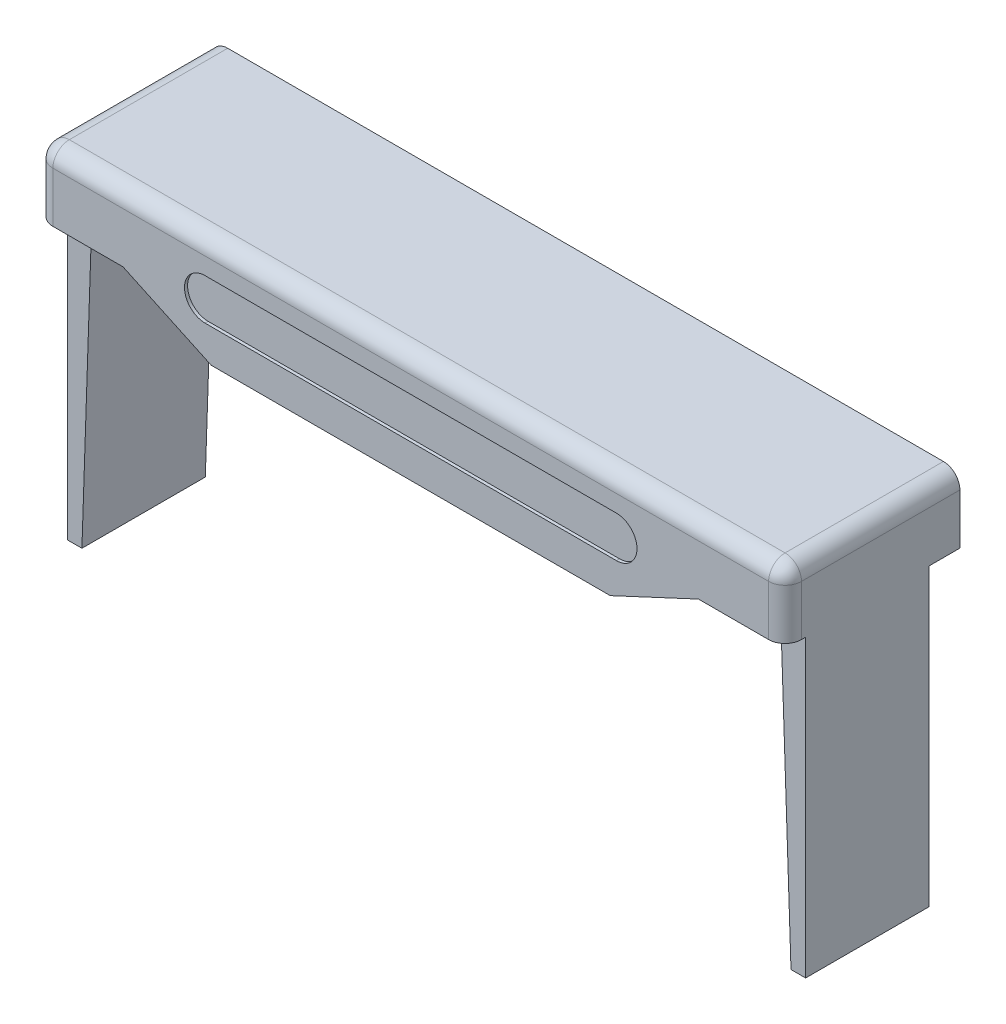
ISO-10303-21;
HEADER;
FILE_DESCRIPTION(('STEP AP214'),'2;1');
FILE_NAME('part.step','',(''),(''),'','','');
FILE_SCHEMA(('AUTOMOTIVE_DESIGN { 1 0 10303 214 1 1 1 1 }'));
ENDSEC;
DATA;
#1=APPLICATION_CONTEXT('core data for automotive mechanical design processes');
#2=APPLICATION_PROTOCOL_DEFINITION('international standard','automotive_design',2000,#1);
#3=PRODUCT_CONTEXT('',#1,'mechanical');
#4=PRODUCT('Part','Part','',(#3));
#5=PRODUCT_RELATED_PRODUCT_CATEGORY('part','',(#4));
#6=PRODUCT_DEFINITION_FORMATION('','',#4);
#7=PRODUCT_DEFINITION_CONTEXT('part definition',#1,'design');
#8=PRODUCT_DEFINITION('design','',#6,#7);
#9=PRODUCT_DEFINITION_SHAPE('','',#8);
#10=(LENGTH_UNIT() NAMED_UNIT(*) SI_UNIT(.MILLI.,.METRE.));
#11=(NAMED_UNIT(*) PLANE_ANGLE_UNIT() SI_UNIT($,.RADIAN.));
#12=(NAMED_UNIT(*) SI_UNIT($,.STERADIAN.) SOLID_ANGLE_UNIT());
#13=UNCERTAINTY_MEASURE_WITH_UNIT(LENGTH_MEASURE(1.E-05),#10,'distance_accuracy_value','');
#14=(GEOMETRIC_REPRESENTATION_CONTEXT(3) GLOBAL_UNCERTAINTY_ASSIGNED_CONTEXT((#13)) GLOBAL_UNIT_ASSIGNED_CONTEXT((#10,
#11,#12)) REPRESENTATION_CONTEXT('',''));
#15=CARTESIAN_POINT('',(0.,0.,0.));
#16=DIRECTION('',(0.,0.,1.));
#17=DIRECTION('',(1.,0.,0.));
#18=AXIS2_PLACEMENT_3D('',#15,#16,#17);
#19=CARTESIAN_POINT('',(0.,-4.,-5.5));
#20=DIRECTION('',(0.,0.,-1.));
#21=DIRECTION('',(0.,1.,0.));
#22=AXIS2_PLACEMENT_3D('',#19,#20,#21);
#23=PLANE('',#22);
#24=DIRECTION('',(-0.0340228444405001,0.999421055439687,0.));
#25=VECTOR('',#24,1.);
#26=CARTESIAN_POINT('',(34.9770212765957,-28.7,-5.5));
#27=LINE('',#26,#25);
#28=CARTESIAN_POINT('',(34.9770212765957,-28.7,-5.5));
#29=VERTEX_POINT('',#28);
#30=CARTESIAN_POINT('',(34.,0.,-5.5));
#31=VERTEX_POINT('',#30);
#32=EDGE_CURVE('E439',#29,#31,#27,.T.);
#33=ORIENTED_EDGE('',*,*,#32,.T.);
#34=DIRECTION('',(1.,0.,0.));
#35=VECTOR('',#34,1.);
#36=CARTESIAN_POINT('',(36.4,0.,-5.5));
#37=LINE('',#36,#35);
#38=CARTESIAN_POINT('',(36.4,0.,-5.5));
#39=VERTEX_POINT('',#38);
#40=EDGE_CURVE('E311',#31,#39,#37,.T.);
#41=ORIENTED_EDGE('',*,*,#40,.T.);
#42=DIRECTION('',(0.,-1.,0.));
#43=VECTOR('',#42,1.);
#44=CARTESIAN_POINT('',(36.4,0.,-5.5));
#45=LINE('',#44,#43);
#46=CARTESIAN_POINT('',(36.4,-28.7,-5.5));
#47=VERTEX_POINT('',#46);
#48=EDGE_CURVE('E296',#39,#47,#45,.T.);
#49=ORIENTED_EDGE('',*,*,#48,.T.);
#50=DIRECTION('',(-1.,0.,0.));
#51=VECTOR('',#50,1.);
#52=CARTESIAN_POINT('',(36.4,-28.7,-5.5));
#53=LINE('',#52,#51);
#54=EDGE_CURVE('E544',#47,#29,#53,.T.);
#55=ORIENTED_EDGE('',*,*,#54,.T.);
#56=EDGE_LOOP('',(#33,#41,#49,#55));
#57=FACE_BOUND('',#56,.T.);
#58=ADVANCED_FACE('F15',(#57),#23,.T.);
#59=CARTESIAN_POINT('',(0.,-4.,5.5));
#60=DIRECTION('',(0.,0.,1.));
#61=DIRECTION('',(1.,0.,0.));
#62=AXIS2_PLACEMENT_3D('',#59,#60,#61);
#63=PLANE('',#62);
#64=DIRECTION('',(0.0340228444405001,0.999421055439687,0.));
#65=VECTOR('',#64,1.);
#66=CARTESIAN_POINT('',(-34.9770212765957,-28.7,5.5));
#67=LINE('',#66,#65);
#68=CARTESIAN_POINT('',(-34.9770212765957,-28.7,5.5));
#69=VERTEX_POINT('',#68);
#70=CARTESIAN_POINT('',(-34.,0.,5.5));
#71=VERTEX_POINT('',#70);
#72=EDGE_CURVE('E478',#69,#71,#67,.T.);
#73=ORIENTED_EDGE('',*,*,#72,.T.);
#74=DIRECTION('',(-1.,0.,0.));
#75=VECTOR('',#74,1.);
#76=CARTESIAN_POINT('',(-36.4,0.,5.5));
#77=LINE('',#76,#75);
#78=CARTESIAN_POINT('',(-36.4,0.,5.5));
#79=VERTEX_POINT('',#78);
#80=EDGE_CURVE('E289',#71,#79,#77,.T.);
#81=ORIENTED_EDGE('',*,*,#80,.T.);
#82=DIRECTION('',(0.,-1.,0.));
#83=VECTOR('',#82,1.);
#84=CARTESIAN_POINT('',(-36.4,0.,5.5));
#85=LINE('',#84,#83);
#86=CARTESIAN_POINT('',(-36.4,-28.7,5.5));
#87=VERTEX_POINT('',#86);
#88=EDGE_CURVE('E367',#79,#87,#85,.T.);
#89=ORIENTED_EDGE('',*,*,#88,.T.);
#90=DIRECTION('',(1.,0.,0.));
#91=VECTOR('',#90,1.);
#92=CARTESIAN_POINT('',(-36.4,-28.7,5.5));
#93=LINE('',#92,#91);
#94=EDGE_CURVE('E457',#87,#69,#93,.T.);
#95=ORIENTED_EDGE('',*,*,#94,.T.);
#96=EDGE_LOOP('',(#73,#81,#89,#95));
#97=FACE_BOUND('',#96,.T.);
#98=ADVANCED_FACE('F527',(#97),#63,.T.);
#99=CARTESIAN_POINT('',(20.,1.25,8.2));
#100=DIRECTION('',(0.,0.,-1.));
#101=DIRECTION('',(0.,1.,0.));
#102=AXIS2_PLACEMENT_3D('',#99,#100,#101);
#103=PLANE('',#102);
#104=CARTESIAN_POINT('',(20.,1.25,8.2));
#105=DIRECTION('',(0.,0.,-1.));
#106=DIRECTION('',(0.,1.,0.));
#107=AXIS2_PLACEMENT_3D('',#104,#105,#106);
#108=CIRCLE('',#107,2.);
#109=CARTESIAN_POINT('',(20.,3.25,8.2));
#110=VERTEX_POINT('',#109);
#111=CARTESIAN_POINT('',(20.,-0.75,8.2));
#112=VERTEX_POINT('',#111);
#113=EDGE_CURVE('E274',#110,#112,#108,.T.);
#114=ORIENTED_EDGE('',*,*,#113,.F.);
#115=DIRECTION('',(1.,0.,0.));
#116=VECTOR('',#115,1.);
#117=CARTESIAN_POINT('',(20.,3.25,8.2));
#118=LINE('',#117,#116);
#119=CARTESIAN_POINT('',(-20.,3.25,8.2));
#120=VERTEX_POINT('',#119);
#121=EDGE_CURVE('E10',#120,#110,#118,.T.);
#122=ORIENTED_EDGE('',*,*,#121,.F.);
#123=CARTESIAN_POINT('',(-20.,1.25,8.2));
#124=DIRECTION('',(0.,0.,-1.));
#125=DIRECTION('',(0.,1.,0.));
#126=AXIS2_PLACEMENT_3D('',#123,#124,#125);
#127=CIRCLE('',#126,2.);
#128=CARTESIAN_POINT('',(-20.,-0.75,8.2));
#129=VERTEX_POINT('',#128);
#130=EDGE_CURVE('E40',#129,#120,#127,.T.);
#131=ORIENTED_EDGE('',*,*,#130,.F.);
#132=DIRECTION('',(-1.,0.,0.));
#133=VECTOR('',#132,1.);
#134=CARTESIAN_POINT('',(20.,-0.75,8.2));
#135=LINE('',#134,#133);
#136=EDGE_CURVE('E340',#112,#129,#135,.T.);
#137=ORIENTED_EDGE('',*,*,#136,.F.);
#138=EDGE_LOOP('',(#114,#122,#131,#137));
#139=FACE_BOUND('',#138,.T.);
#140=ADVANCED_FACE('F525',(#139),#103,.F.);
#141=CARTESIAN_POINT('',(20.,3.25,8.2));
#142=DIRECTION('',(0.,-1.,0.));
#143=DIRECTION('',(1.,0.,0.));
#144=AXIS2_PLACEMENT_3D('',#141,#142,#143);
#145=PLANE('',#144);
#146=DIRECTION('',(1.,0.,0.));
#147=VECTOR('',#146,1.);
#148=CARTESIAN_POINT('',(20.,3.25,8.5));
#149=LINE('',#148,#147);
#150=CARTESIAN_POINT('',(-20.,3.25,8.5));
#151=VERTEX_POINT('',#150);
#152=CARTESIAN_POINT('',(20.,3.25,8.5));
#153=VERTEX_POINT('',#152);
#154=EDGE_CURVE('E360',#151,#153,#149,.T.);
#155=ORIENTED_EDGE('',*,*,#154,.F.);
#156=DIRECTION('',(0.,0.,1.));
#157=VECTOR('',#156,1.);
#158=CARTESIAN_POINT('',(-20.,3.25,8.2));
#159=LINE('',#158,#157);
#160=EDGE_CURVE('E18',#120,#151,#159,.T.);
#161=ORIENTED_EDGE('',*,*,#160,.F.);
#162=ORIENTED_EDGE('',*,*,#121,.T.);
#163=DIRECTION('',(0.,0.,1.));
#164=VECTOR('',#163,1.);
#165=CARTESIAN_POINT('',(20.,3.25,8.2));
#166=LINE('',#165,#164);
#167=EDGE_CURVE('E271',#110,#153,#166,.T.);
#168=ORIENTED_EDGE('',*,*,#167,.T.);
#169=EDGE_LOOP('',(#155,#161,#162,#168));
#170=FACE_BOUND('',#169,.T.);
#171=ADVANCED_FACE('F361',(#170),#145,.T.);
#172=CARTESIAN_POINT('',(-20.,1.25,8.2));
#173=DIRECTION('',(0.,0.,1.));
#174=DIRECTION('',(0.,-1.,0.));
#175=AXIS2_PLACEMENT_3D('',#172,#173,#174);
#176=CYLINDRICAL_SURFACE('',#175,2.);
#177=CARTESIAN_POINT('',(-20.,1.25,8.5));
#178=DIRECTION('',(0.,0.,-1.));
#179=DIRECTION('',(0.,1.,0.));
#180=AXIS2_PLACEMENT_3D('',#177,#178,#179);
#181=CIRCLE('',#180,2.);
#182=CARTESIAN_POINT('',(-20.,-0.75,8.5));
#183=VERTEX_POINT('',#182);
#184=EDGE_CURVE('E356',#183,#151,#181,.T.);
#185=ORIENTED_EDGE('',*,*,#184,.F.);
#186=DIRECTION('',(0.,0.,1.));
#187=VECTOR('',#186,1.);
#188=CARTESIAN_POINT('',(-20.,-0.75,8.2));
#189=LINE('',#188,#187);
#190=EDGE_CURVE('E344',#129,#183,#189,.T.);
#191=ORIENTED_EDGE('',*,*,#190,.F.);
#192=ORIENTED_EDGE('',*,*,#130,.T.);
#193=ORIENTED_EDGE('',*,*,#160,.T.);
#194=EDGE_LOOP('',(#185,#191,#192,#193));
#195=FACE_BOUND('',#194,.T.);
#196=ADVANCED_FACE('F354',(#195),#176,.F.);
#197=CARTESIAN_POINT('',(20.,-0.75,8.2));
#198=DIRECTION('',(0.,1.,0.));
#199=DIRECTION('',(0.,0.,-1.));
#200=AXIS2_PLACEMENT_3D('',#197,#198,#199);
#201=PLANE('',#200);
#202=DIRECTION('',(-1.,0.,0.));
#203=VECTOR('',#202,1.);
#204=CARTESIAN_POINT('',(20.,-0.75,8.5));
#205=LINE('',#204,#203);
#206=CARTESIAN_POINT('',(20.,-0.75,8.5));
#207=VERTEX_POINT('',#206);
#208=EDGE_CURVE('E372',#207,#183,#205,.T.);
#209=ORIENTED_EDGE('',*,*,#208,.F.);
#210=DIRECTION('',(0.,0.,1.));
#211=VECTOR('',#210,1.);
#212=CARTESIAN_POINT('',(20.,-0.75,8.2));
#213=LINE('',#212,#211);
#214=EDGE_CURVE('E337',#112,#207,#213,.T.);
#215=ORIENTED_EDGE('',*,*,#214,.F.);
#216=ORIENTED_EDGE('',*,*,#136,.T.);
#217=ORIENTED_EDGE('',*,*,#190,.T.);
#218=EDGE_LOOP('',(#209,#215,#216,#217));
#219=FACE_BOUND('',#218,.T.);
#220=ADVANCED_FACE('F524',(#219),#201,.T.);
#221=CARTESIAN_POINT('',(20.,1.25,8.2));
#222=DIRECTION('',(0.,0.,1.));
#223=DIRECTION('',(0.,-1.,0.));
#224=AXIS2_PLACEMENT_3D('',#221,#222,#223);
#225=CYLINDRICAL_SURFACE('',#224,2.);
#226=CARTESIAN_POINT('',(20.,1.25,8.5));
#227=DIRECTION('',(0.,0.,-1.));
#228=DIRECTION('',(0.,1.,0.));
#229=AXIS2_PLACEMENT_3D('',#226,#227,#228);
#230=CIRCLE('',#229,2.);
#231=EDGE_CURVE('E378',#153,#207,#230,.T.);
#232=ORIENTED_EDGE('',*,*,#231,.F.);
#233=ORIENTED_EDGE('',*,*,#167,.F.);
#234=ORIENTED_EDGE('',*,*,#113,.T.);
#235=ORIENTED_EDGE('',*,*,#214,.T.);
#236=EDGE_LOOP('',(#232,#233,#234,#235));
#237=FACE_BOUND('',#236,.T.);
#238=ADVANCED_FACE('F521',(#237),#225,.F.);
#239=CARTESIAN_POINT('',(34.8,4.9,-8.5));
#240=DIRECTION('',(0.,0.,1.));
#241=DIRECTION('',(0.,-1.,0.));
#242=AXIS2_PLACEMENT_3D('',#239,#240,#241);
#243=CYLINDRICAL_SURFACE('',#242,1.6);
#244=CARTESIAN_POINT('',(34.8,4.9,-8.5));
#245=DIRECTION('',(0.,0.,-1.));
#246=DIRECTION('',(0.,1.,0.));
#247=AXIS2_PLACEMENT_3D('',#244,#245,#246);
#248=CIRCLE('',#247,1.6);
#249=CARTESIAN_POINT('',(34.8,6.5,-8.5));
#250=VERTEX_POINT('',#249);
#251=CARTESIAN_POINT('',(36.4,4.9,-8.5));
#252=VERTEX_POINT('',#251);
#253=EDGE_CURVE('E232',#250,#252,#248,.T.);
#254=ORIENTED_EDGE('',*,*,#253,.F.);
#255=DIRECTION('',(0.,0.,-1.));
#256=VECTOR('',#255,1.);
#257=CARTESIAN_POINT('',(34.8,6.5,-8.5));
#258=LINE('',#257,#256);
#259=CARTESIAN_POINT('',(34.8,6.5,6.9));
#260=VERTEX_POINT('',#259);
#261=EDGE_CURVE('E281',#260,#250,#258,.T.);
#262=ORIENTED_EDGE('',*,*,#261,.F.);
#263=CARTESIAN_POINT('',(34.8,4.9,6.9));
#264=DIRECTION('',(0.,0.,-1.));
#265=DIRECTION('',(0.,-1.,0.));
#266=AXIS2_PLACEMENT_3D('',#263,#264,#265);
#267=CIRCLE('',#266,1.6);
#268=CARTESIAN_POINT('',(36.4,4.9,6.9));
#269=VERTEX_POINT('',#268);
#270=EDGE_CURVE('E234',#260,#269,#267,.T.);
#271=ORIENTED_EDGE('',*,*,#270,.T.);
#272=DIRECTION('',(0.,0.,1.));
#273=VECTOR('',#272,1.);
#274=CARTESIAN_POINT('',(36.4,4.9,-8.5));
#275=LINE('',#274,#273);
#276=EDGE_CURVE('E227',#252,#269,#275,.T.);
#277=ORIENTED_EDGE('',*,*,#276,.F.);
#278=EDGE_LOOP('',(#254,#262,#271,#277));
#279=FACE_BOUND('',#278,.T.);
#280=ADVANCED_FACE('F229',(#279),#243,.T.);
#281=CARTESIAN_POINT('',(34.8,4.9,6.9));
#282=DIRECTION('',(0.,0.,1.));
#283=DIRECTION('',(1.,0.,0.));
#284=AXIS2_PLACEMENT_3D('',#281,#282,#283);
#285=SPHERICAL_SURFACE('',#284,1.6);
#286=CARTESIAN_POINT('',(34.8,4.9,6.9));
#287=DIRECTION('',(1.,0.,0.));
#288=DIRECTION('',(0.,1.,0.));
#289=AXIS2_PLACEMENT_3D('',#286,#287,#288);
#290=CIRCLE('',#289,1.6);
#291=CARTESIAN_POINT('',(34.8,4.9,8.5));
#292=VERTEX_POINT('',#291);
#293=EDGE_CURVE('E331',#260,#292,#290,.T.);
#294=ORIENTED_EDGE('',*,*,#293,.T.);
#295=CARTESIAN_POINT('',(34.8,4.9,6.9));
#296=DIRECTION('',(0.,1.,0.));
#297=DIRECTION('',(-1.,0.,0.));
#298=AXIS2_PLACEMENT_3D('',#295,#296,#297);
#299=CIRCLE('',#298,1.6);
#300=EDGE_CURVE('E328',#292,#269,#299,.T.);
#301=ORIENTED_EDGE('',*,*,#300,.T.);
#302=ORIENTED_EDGE('',*,*,#270,.F.);
#303=EDGE_LOOP('',(#294,#301,#302));
#304=FACE_BOUND('',#303,.T.);
#305=ADVANCED_FACE('F599',(#304),#285,.T.);
#306=CARTESIAN_POINT('',(-36.4,4.9,6.9));
#307=DIRECTION('',(1.,0.,0.));
#308=DIRECTION('',(0.,1.,0.));
#309=AXIS2_PLACEMENT_3D('',#306,#307,#308);
#310=CYLINDRICAL_SURFACE('',#309,1.6);
#311=CARTESIAN_POINT('',(-34.8,4.9,6.9));
#312=DIRECTION('',(1.,0.,0.));
#313=DIRECTION('',(0.,-1.,0.));
#314=AXIS2_PLACEMENT_3D('',#311,#312,#313);
#315=CIRCLE('',#314,1.6);
#316=CARTESIAN_POINT('',(-34.8,6.5,6.9));
#317=VERTEX_POINT('',#316);
#318=CARTESIAN_POINT('',(-34.8,4.9,8.5));
#319=VERTEX_POINT('',#318);
#320=EDGE_CURVE('E325',#317,#319,#315,.T.);
#321=ORIENTED_EDGE('',*,*,#320,.T.);
#322=DIRECTION('',(-1.,0.,0.));
#323=VECTOR('',#322,1.);
#324=CARTESIAN_POINT('',(-36.4,4.9,8.5));
#325=LINE('',#324,#323);
#326=EDGE_CURVE('E491',#292,#319,#325,.T.);
#327=ORIENTED_EDGE('',*,*,#326,.F.);
#328=ORIENTED_EDGE('',*,*,#293,.F.);
#329=DIRECTION('',(1.,0.,0.));
#330=VECTOR('',#329,1.);
#331=CARTESIAN_POINT('',(36.4,6.5,6.9));
#332=LINE('',#331,#330);
#333=EDGE_CURVE('E280',#317,#260,#332,.T.);
#334=ORIENTED_EDGE('',*,*,#333,.F.);
#335=EDGE_LOOP('',(#321,#327,#328,#334));
#336=FACE_BOUND('',#335,.T.);
#337=ADVANCED_FACE('F595',(#336),#310,.T.);
#338=CARTESIAN_POINT('',(34.8,-4.,6.9));
#339=DIRECTION('',(0.,1.,0.));
#340=DIRECTION('',(-1.,0.,0.));
#341=AXIS2_PLACEMENT_3D('',#338,#339,#340);
#342=CYLINDRICAL_SURFACE('',#341,1.6);
#343=CARTESIAN_POINT('',(34.8,0.,6.9));
#344=DIRECTION('',(0.,-1.,0.));
#345=DIRECTION('',(1.,0.,0.));
#346=AXIS2_PLACEMENT_3D('',#343,#344,#345);
#347=CIRCLE('',#346,1.6);
#348=CARTESIAN_POINT('',(36.4,0.,6.9));
#349=VERTEX_POINT('',#348);
#350=CARTESIAN_POINT('',(34.8,0.,8.5));
#351=VERTEX_POINT('',#350);
#352=EDGE_CURVE('E315',#349,#351,#347,.T.);
#353=ORIENTED_EDGE('',*,*,#352,.F.);
#354=DIRECTION('',(0.,-1.,0.));
#355=VECTOR('',#354,1.);
#356=CARTESIAN_POINT('',(36.4,0.,6.9));
#357=LINE('',#356,#355);
#358=EDGE_CURVE('E239',#269,#349,#357,.T.);
#359=ORIENTED_EDGE('',*,*,#358,.F.);
#360=ORIENTED_EDGE('',*,*,#300,.F.);
#361=DIRECTION('',(0.,1.,0.));
#362=VECTOR('',#361,1.);
#363=CARTESIAN_POINT('',(34.8,6.5,8.5));
#364=LINE('',#363,#362);
#365=EDGE_CURVE('E487',#351,#292,#364,.T.);
#366=ORIENTED_EDGE('',*,*,#365,.F.);
#367=EDGE_LOOP('',(#353,#359,#360,#366));
#368=FACE_BOUND('',#367,.T.);
#369=ADVANCED_FACE('F603',(#368),#342,.T.);
#370=CARTESIAN_POINT('',(-34.8,4.9,6.9));
#371=DIRECTION('',(0.,0.,1.));
#372=DIRECTION('',(1.,0.,0.));
#373=AXIS2_PLACEMENT_3D('',#370,#371,#372);
#374=SPHERICAL_SURFACE('',#373,1.6);
#375=CARTESIAN_POINT('',(-34.8,4.9,6.9));
#376=DIRECTION('',(0.,0.,1.));
#377=DIRECTION('',(0.,-1.,0.));
#378=AXIS2_PLACEMENT_3D('',#375,#376,#377);
#379=CIRCLE('',#378,1.6);
#380=CARTESIAN_POINT('',(-36.4,4.9,6.9));
#381=VERTEX_POINT('',#380);
#382=EDGE_CURVE('E322',#317,#381,#379,.T.);
#383=ORIENTED_EDGE('',*,*,#382,.T.);
#384=CARTESIAN_POINT('',(-34.8,4.9,6.9));
#385=DIRECTION('',(0.,1.,0.));
#386=DIRECTION('',(-1.,0.,0.));
#387=AXIS2_PLACEMENT_3D('',#384,#385,#386);
#388=CIRCLE('',#387,1.6);
#389=EDGE_CURVE('E318',#381,#319,#388,.T.);
#390=ORIENTED_EDGE('',*,*,#389,.T.);
#391=ORIENTED_EDGE('',*,*,#320,.F.);
#392=EDGE_LOOP('',(#383,#390,#391));
#393=FACE_BOUND('',#392,.T.);
#394=ADVANCED_FACE('F640',(#393),#374,.T.);
#395=CARTESIAN_POINT('',(-34.8,4.9,-8.5));
#396=DIRECTION('',(0.,0.,1.));
#397=DIRECTION('',(0.,-1.,0.));
#398=AXIS2_PLACEMENT_3D('',#395,#396,#397);
#399=CYLINDRICAL_SURFACE('',#398,1.6);
#400=CARTESIAN_POINT('',(-34.8,4.9,-8.5));
#401=DIRECTION('',(0.,0.,-1.));
#402=DIRECTION('',(0.,1.,0.));
#403=AXIS2_PLACEMENT_3D('',#400,#401,#402);
#404=CIRCLE('',#403,1.6);
#405=CARTESIAN_POINT('',(-36.4,4.9,-8.5));
#406=VERTEX_POINT('',#405);
#407=CARTESIAN_POINT('',(-34.8,6.5,-8.5));
#408=VERTEX_POINT('',#407);
#409=EDGE_CURVE('E277',#406,#408,#404,.T.);
#410=ORIENTED_EDGE('',*,*,#409,.F.);
#411=DIRECTION('',(0.,0.,-1.));
#412=VECTOR('',#411,1.);
#413=CARTESIAN_POINT('',(-36.4,4.9,-8.5));
#414=LINE('',#413,#412);
#415=EDGE_CURVE('E394',#381,#406,#414,.T.);
#416=ORIENTED_EDGE('',*,*,#415,.F.);
#417=ORIENTED_EDGE('',*,*,#382,.F.);
#418=DIRECTION('',(0.,0.,1.));
#419=VECTOR('',#418,1.);
#420=CARTESIAN_POINT('',(-34.8,6.5,-8.5));
#421=LINE('',#420,#419);
#422=EDGE_CURVE('E283',#408,#317,#421,.T.);
#423=ORIENTED_EDGE('',*,*,#422,.F.);
#424=EDGE_LOOP('',(#410,#416,#417,#423));
#425=FACE_BOUND('',#424,.T.);
#426=ADVANCED_FACE('F589',(#425),#399,.T.);
#427=CARTESIAN_POINT('',(-34.8,6.5,6.9));
#428=DIRECTION('',(0.,1.,0.));
#429=DIRECTION('',(-1.,0.,0.));
#430=AXIS2_PLACEMENT_3D('',#427,#428,#429);
#431=CYLINDRICAL_SURFACE('',#430,1.6);
#432=CARTESIAN_POINT('',(-34.8,0.,6.9));
#433=DIRECTION('',(0.,-1.,0.));
#434=DIRECTION('',(1.,0.,0.));
#435=AXIS2_PLACEMENT_3D('',#432,#433,#434);
#436=CIRCLE('',#435,1.6);
#437=CARTESIAN_POINT('',(-34.8,0.,8.5));
#438=VERTEX_POINT('',#437);
#439=CARTESIAN_POINT('',(-36.4,0.,6.9));
#440=VERTEX_POINT('',#439);
#441=EDGE_CURVE('E293',#438,#440,#436,.T.);
#442=ORIENTED_EDGE('',*,*,#441,.F.);
#443=DIRECTION('',(0.,-1.,0.));
#444=VECTOR('',#443,1.);
#445=CARTESIAN_POINT('',(-34.8,0.,8.5));
#446=LINE('',#445,#444);
#447=EDGE_CURVE('E497',#319,#438,#446,.T.);
#448=ORIENTED_EDGE('',*,*,#447,.F.);
#449=ORIENTED_EDGE('',*,*,#389,.F.);
#450=DIRECTION('',(0.,1.,0.));
#451=VECTOR('',#450,1.);
#452=CARTESIAN_POINT('',(-36.4,6.5,6.9));
#453=LINE('',#452,#451);
#454=EDGE_CURVE('E390',#440,#381,#453,.T.);
#455=ORIENTED_EDGE('',*,*,#454,.F.);
#456=EDGE_LOOP('',(#442,#448,#449,#455));
#457=FACE_BOUND('',#456,.T.);
#458=ADVANCED_FACE('F607',(#457),#431,.T.);
#459=CARTESIAN_POINT('',(0.,-4.,6.5));
#460=DIRECTION('',(0.,0.,1.));
#461=DIRECTION('',(1.,0.,0.));
#462=AXIS2_PLACEMENT_3D('',#459,#460,#461);
#463=PLANE('',#462);
#464=DIRECTION('',(-1.,0.,0.));
#465=VECTOR('',#464,1.);
#466=CARTESIAN_POINT('',(34.9770212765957,-28.7,6.5));
#467=LINE('',#466,#465);
#468=CARTESIAN_POINT('',(36.4,-28.7,6.5));
#469=VERTEX_POINT('',#468);
#470=CARTESIAN_POINT('',(34.9770212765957,-28.7,6.5));
#471=VERTEX_POINT('',#470);
#472=EDGE_CURVE('E432',#469,#471,#467,.T.);
#473=ORIENTED_EDGE('',*,*,#472,.F.);
#474=DIRECTION('',(0.,-1.,0.));
#475=VECTOR('',#474,1.);
#476=CARTESIAN_POINT('',(36.4,0.,6.5));
#477=LINE('',#476,#475);
#478=CARTESIAN_POINT('',(36.4,0.,6.5));
#479=VERTEX_POINT('',#478);
#480=EDGE_CURVE('E307',#479,#469,#477,.T.);
#481=ORIENTED_EDGE('',*,*,#480,.F.);
#482=DIRECTION('',(1.,0.,0.));
#483=VECTOR('',#482,1.);
#484=CARTESIAN_POINT('',(36.4,0.,6.5));
#485=LINE('',#484,#483);
#486=CARTESIAN_POINT('',(34.,0.,6.5));
#487=VERTEX_POINT('',#486);
#488=EDGE_CURVE('E314',#487,#479,#485,.T.);
#489=ORIENTED_EDGE('',*,*,#488,.F.);
#490=DIRECTION('',(-0.0340228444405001,0.999421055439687,0.));
#491=VECTOR('',#490,1.);
#492=CARTESIAN_POINT('',(34.9770212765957,-28.7,6.5));
#493=LINE('',#492,#491);
#494=EDGE_CURVE('E444',#471,#487,#493,.T.);
#495=ORIENTED_EDGE('',*,*,#494,.F.);
#496=EDGE_LOOP('',(#473,#481,#489,#495));
#497=FACE_BOUND('',#496,.T.);
#498=ADVANCED_FACE('F556',(#497),#463,.T.);
#499=CARTESIAN_POINT('',(27.9780276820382,0.,8.5));
#500=DIRECTION('',(0.,-1.,0.));
#501=DIRECTION('',(1.,0.,0.));
#502=AXIS2_PLACEMENT_3D('',#499,#500,#501);
#503=PLANE('',#502);
#504=ORIENTED_EDGE('',*,*,#40,.F.);
#505=DIRECTION('',(0.,0.,-1.));
#506=VECTOR('',#505,1.);
#507=CARTESIAN_POINT('',(34.,0.,6.5));
#508=LINE('',#507,#506);
#509=EDGE_CURVE('E453',#487,#31,#508,.T.);
#510=ORIENTED_EDGE('',*,*,#509,.F.);
#511=ORIENTED_EDGE('',*,*,#488,.T.);
#512=DIRECTION('',(0.,0.,-1.));
#513=VECTOR('',#512,1.);
#514=CARTESIAN_POINT('',(36.4,0.,8.5));
#515=LINE('',#514,#513);
#516=EDGE_CURVE('E303',#349,#479,#515,.T.);
#517=ORIENTED_EDGE('',*,*,#516,.F.);
#518=ORIENTED_EDGE('',*,*,#352,.T.);
#519=DIRECTION('',(1.,0.,0.));
#520=VECTOR('',#519,1.);
#521=CARTESIAN_POINT('',(27.9780276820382,0.,8.5));
#522=LINE('',#521,#520);
#523=CARTESIAN_POINT('',(27.9780276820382,0.,8.5));
#524=VERTEX_POINT('',#523);
#525=EDGE_CURVE('E483',#524,#351,#522,.T.);
#526=ORIENTED_EDGE('',*,*,#525,.F.);
#527=DIRECTION('',(0.,0.,-1.));
#528=VECTOR('',#527,1.);
#529=CARTESIAN_POINT('',(27.9780276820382,0.,8.5));
#530=LINE('',#529,#528);
#531=CARTESIAN_POINT('',(27.9780276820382,0.,-8.5));
#532=VERTEX_POINT('',#531);
#533=EDGE_CURVE('E310',#524,#532,#530,.T.);
#534=ORIENTED_EDGE('',*,*,#533,.T.);
#535=DIRECTION('',(1.,0.,0.));
#536=VECTOR('',#535,1.);
#537=CARTESIAN_POINT('',(36.4,0.,-8.5));
#538=LINE('',#537,#536);
#539=CARTESIAN_POINT('',(36.4,0.,-8.5));
#540=VERTEX_POINT('',#539);
#541=EDGE_CURVE('E251',#532,#540,#538,.T.);
#542=ORIENTED_EDGE('',*,*,#541,.T.);
#543=DIRECTION('',(0.,0.,-1.));
#544=VECTOR('',#543,1.);
#545=CARTESIAN_POINT('',(36.4,0.,8.5));
#546=LINE('',#545,#544);
#547=EDGE_CURVE('E240',#39,#540,#546,.T.);
#548=ORIENTED_EDGE('',*,*,#547,.F.);
#549=EDGE_LOOP('',(#504,#510,#511,#517,#518,#526,#534,#542,#548));
#550=FACE_BOUND('',#549,.T.);
#551=ADVANCED_FACE('F559',(#550),#503,.T.);
#552=CARTESIAN_POINT('',(19.4,-4.,8.5));
#553=DIRECTION('',(0.4226182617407,-0.90630778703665,0.));
#554=DIRECTION('',(0.,0.,-1.));
#555=AXIS2_PLACEMENT_3D('',#552,#553,#554);
#556=PLANE('',#555);
#557=DIRECTION('',(0.90630778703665,0.4226182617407,0.));
#558=VECTOR('',#557,1.);
#559=CARTESIAN_POINT('',(37.3854280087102,4.386742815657,-8.5));
#560=LINE('',#559,#558);
#561=CARTESIAN_POINT('',(19.4,-4.,-8.5));
#562=VERTEX_POINT('',#561);
#563=EDGE_CURVE('E270',#562,#532,#560,.T.);
#564=ORIENTED_EDGE('',*,*,#563,.T.);
#565=ORIENTED_EDGE('',*,*,#533,.F.);
#566=DIRECTION('',(0.90630778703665,0.4226182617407,0.));
#567=VECTOR('',#566,1.);
#568=CARTESIAN_POINT('',(19.4,-4.,8.5));
#569=LINE('',#568,#567);
#570=CARTESIAN_POINT('',(19.4,-4.,8.5));
#571=VERTEX_POINT('',#570);
#572=EDGE_CURVE('E515',#571,#524,#569,.T.);
#573=ORIENTED_EDGE('',*,*,#572,.F.);
#574=DIRECTION('',(0.,0.,-1.));
#575=VECTOR('',#574,1.);
#576=CARTESIAN_POINT('',(19.4,-4.,8.5));
#577=LINE('',#576,#575);
#578=EDGE_CURVE('E262',#571,#562,#577,.T.);
#579=ORIENTED_EDGE('',*,*,#578,.T.);
#580=EDGE_LOOP('',(#564,#565,#573,#579));
#581=FACE_BOUND('',#580,.T.);
#582=ADVANCED_FACE('F571',(#581),#556,.T.);
#583=CARTESIAN_POINT('',(36.4,-4.,-8.5));
#584=DIRECTION('',(1.,0.,0.));
#585=DIRECTION('',(0.,0.,1.));
#586=AXIS2_PLACEMENT_3D('',#583,#584,#585);
#587=PLANE('',#586);
#588=ORIENTED_EDGE('',*,*,#48,.F.);
#589=ORIENTED_EDGE('',*,*,#547,.T.);
#590=DIRECTION('',(0.,-1.,0.));
#591=VECTOR('',#590,1.);
#592=CARTESIAN_POINT('',(36.4,-4.,-8.5));
#593=LINE('',#592,#591);
#594=EDGE_CURVE('E243',#252,#540,#593,.T.);
#595=ORIENTED_EDGE('',*,*,#594,.F.);
#596=ORIENTED_EDGE('',*,*,#276,.T.);
#597=ORIENTED_EDGE('',*,*,#358,.T.);
#598=ORIENTED_EDGE('',*,*,#516,.T.);
#599=ORIENTED_EDGE('',*,*,#480,.T.);
#600=DIRECTION('',(0.,0.,-1.));
#601=VECTOR('',#600,1.);
#602=CARTESIAN_POINT('',(36.4,-28.7,6.5));
#603=LINE('',#602,#601);
#604=EDGE_CURVE('E436',#469,#47,#603,.T.);
#605=ORIENTED_EDGE('',*,*,#604,.T.);
#606=EDGE_LOOP('',(#588,#589,#595,#596,#597,#598,#599,#605));
#607=FACE_BOUND('',#606,.T.);
#608=ADVANCED_FACE('F245',(#607),#587,.T.);
#609=CARTESIAN_POINT('',(0.,-4.,-6.5));
#610=DIRECTION('',(0.,0.,1.));
#611=DIRECTION('',(1.,0.,0.));
#612=AXIS2_PLACEMENT_3D('',#609,#610,#611);
#613=PLANE('',#612);
#614=DIRECTION('',(1.,0.,0.));
#615=VECTOR('',#614,1.);
#616=CARTESIAN_POINT('',(-34.9770212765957,-28.7,-6.5));
#617=LINE('',#616,#615);
#618=CARTESIAN_POINT('',(-36.4,-28.7,-6.5));
#619=VERTEX_POINT('',#618);
#620=CARTESIAN_POINT('',(-34.9770212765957,-28.7,-6.5));
#621=VERTEX_POINT('',#620);
#622=EDGE_CURVE('E465',#619,#621,#617,.T.);
#623=ORIENTED_EDGE('',*,*,#622,.F.);
#624=DIRECTION('',(0.,-1.,0.));
#625=VECTOR('',#624,1.);
#626=CARTESIAN_POINT('',(-36.4,0.,-6.5));
#627=LINE('',#626,#625);
#628=CARTESIAN_POINT('',(-36.4,0.,-6.5));
#629=VERTEX_POINT('',#628);
#630=EDGE_CURVE('E408',#629,#619,#627,.T.);
#631=ORIENTED_EDGE('',*,*,#630,.F.);
#632=DIRECTION('',(-1.,0.,0.));
#633=VECTOR('',#632,1.);
#634=CARTESIAN_POINT('',(-36.4,0.,-6.5));
#635=LINE('',#634,#633);
#636=CARTESIAN_POINT('',(-34.,0.,-6.5));
#637=VERTEX_POINT('',#636);
#638=EDGE_CURVE('E292',#637,#629,#635,.T.);
#639=ORIENTED_EDGE('',*,*,#638,.F.);
#640=DIRECTION('',(0.0340228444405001,0.999421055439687,0.));
#641=VECTOR('',#640,1.);
#642=CARTESIAN_POINT('',(-34.9770212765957,-28.7,-6.5));
#643=LINE('',#642,#641);
#644=EDGE_CURVE('E482',#621,#637,#643,.T.);
#645=ORIENTED_EDGE('',*,*,#644,.F.);
#646=EDGE_LOOP('',(#623,#631,#639,#645));
#647=FACE_BOUND('',#646,.T.);
#648=ADVANCED_FACE('F618',(#647),#613,.F.);
#649=CARTESIAN_POINT('',(-27.9780276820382,0.,8.5));
#650=DIRECTION('',(0.,-1.,0.));
#651=DIRECTION('',(1.,0.,0.));
#652=AXIS2_PLACEMENT_3D('',#649,#650,#651);
#653=PLANE('',#652);
#654=ORIENTED_EDGE('',*,*,#80,.F.);
#655=DIRECTION('',(0.,0.,-1.));
#656=VECTOR('',#655,1.);
#657=CARTESIAN_POINT('',(-34.,0.,6.5));
#658=LINE('',#657,#656);
#659=EDGE_CURVE('E430',#71,#637,#658,.T.);
#660=ORIENTED_EDGE('',*,*,#659,.T.);
#661=ORIENTED_EDGE('',*,*,#638,.T.);
#662=DIRECTION('',(0.,0.,-1.));
#663=VECTOR('',#662,1.);
#664=CARTESIAN_POINT('',(-36.4,0.,8.5));
#665=LINE('',#664,#663);
#666=CARTESIAN_POINT('',(-36.4,0.,-8.5));
#667=VERTEX_POINT('',#666);
#668=EDGE_CURVE('E403',#629,#667,#665,.T.);
#669=ORIENTED_EDGE('',*,*,#668,.T.);
#670=DIRECTION('',(-1.,0.,0.));
#671=VECTOR('',#670,1.);
#672=CARTESIAN_POINT('',(-36.4,0.,-8.5));
#673=LINE('',#672,#671);
#674=CARTESIAN_POINT('',(-27.9780276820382,0.,-8.5));
#675=VERTEX_POINT('',#674);
#676=EDGE_CURVE('E269',#675,#667,#673,.T.);
#677=ORIENTED_EDGE('',*,*,#676,.F.);
#678=DIRECTION('',(0.,0.,-1.));
#679=VECTOR('',#678,1.);
#680=CARTESIAN_POINT('',(-27.9780276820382,0.,8.5));
#681=LINE('',#680,#679);
#682=CARTESIAN_POINT('',(-27.9780276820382,0.,8.5));
#683=VERTEX_POINT('',#682);
#684=EDGE_CURVE('E288',#683,#675,#681,.T.);
#685=ORIENTED_EDGE('',*,*,#684,.F.);
#686=DIRECTION('',(-1.,0.,0.));
#687=VECTOR('',#686,1.);
#688=CARTESIAN_POINT('',(-27.9780276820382,0.,8.5));
#689=LINE('',#688,#687);
#690=EDGE_CURVE('E501',#683,#438,#689,.T.);
#691=ORIENTED_EDGE('',*,*,#690,.T.);
#692=ORIENTED_EDGE('',*,*,#441,.T.);
#693=DIRECTION('',(0.,0.,-1.));
#694=VECTOR('',#693,1.);
#695=CARTESIAN_POINT('',(-36.4,0.,8.5));
#696=LINE('',#695,#694);
#697=EDGE_CURVE('E386',#440,#79,#696,.T.);
#698=ORIENTED_EDGE('',*,*,#697,.T.);
#699=EDGE_LOOP('',(#654,#660,#661,#669,#677,#685,#691,#692,#698));
#700=FACE_BOUND('',#699,.T.);
#701=ADVANCED_FACE('F580',(#700),#653,.T.);
#702=CARTESIAN_POINT('',(-19.4,-4.,8.5));
#703=DIRECTION('',(-0.4226182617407,-0.90630778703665,0.));
#704=DIRECTION('',(0.,0.,1.));
#705=AXIS2_PLACEMENT_3D('',#702,#703,#704);
#706=PLANE('',#705);
#707=DIRECTION('',(-0.90630778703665,0.4226182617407,0.));
#708=VECTOR('',#707,1.);
#709=CARTESIAN_POINT('',(-37.3854280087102,4.386742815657,-8.5));
#710=LINE('',#709,#708);
#711=CARTESIAN_POINT('',(-19.4,-4.,-8.5));
#712=VERTEX_POINT('',#711);
#713=EDGE_CURVE('E266',#712,#675,#710,.T.);
#714=ORIENTED_EDGE('',*,*,#713,.F.);
#715=DIRECTION('',(0.,0.,-1.));
#716=VECTOR('',#715,1.);
#717=CARTESIAN_POINT('',(-19.4,-4.,8.5));
#718=LINE('',#717,#716);
#719=CARTESIAN_POINT('',(-19.4,-4.,8.5));
#720=VERTEX_POINT('',#719);
#721=EDGE_CURVE('E404',#720,#712,#718,.T.);
#722=ORIENTED_EDGE('',*,*,#721,.F.);
#723=DIRECTION('',(-0.90630778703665,0.4226182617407,0.));
#724=VECTOR('',#723,1.);
#725=CARTESIAN_POINT('',(-19.4,-4.,8.5));
#726=LINE('',#725,#724);
#727=EDGE_CURVE('E507',#720,#683,#726,.T.);
#728=ORIENTED_EDGE('',*,*,#727,.T.);
#729=ORIENTED_EDGE('',*,*,#684,.T.);
#730=EDGE_LOOP('',(#714,#722,#728,#729));
#731=FACE_BOUND('',#730,.T.);
#732=ADVANCED_FACE('F577',(#731),#706,.T.);
#733=CARTESIAN_POINT('',(-36.4,6.5,-8.5));
#734=DIRECTION('',(0.,1.,0.));
#735=DIRECTION('',(0.,0.,-1.));
#736=AXIS2_PLACEMENT_3D('',#733,#734,#735);
#737=PLANE('',#736);
#738=ORIENTED_EDGE('',*,*,#333,.T.);
#739=ORIENTED_EDGE('',*,*,#261,.T.);
#740=DIRECTION('',(-1.,0.,0.));
#741=VECTOR('',#740,1.);
#742=CARTESIAN_POINT('',(-36.4,6.5,-8.5));
#743=LINE('',#742,#741);
#744=EDGE_CURVE('E256',#250,#408,#743,.T.);
#745=ORIENTED_EDGE('',*,*,#744,.T.);
#746=ORIENTED_EDGE('',*,*,#422,.T.);
#747=EDGE_LOOP('',(#738,#739,#745,#746));
#748=FACE_BOUND('',#747,.T.);
#749=ADVANCED_FACE('F592',(#748),#737,.T.);
#750=CARTESIAN_POINT('',(-36.4,6.5,-8.5));
#751=DIRECTION('',(0.,0.,-1.));
#752=DIRECTION('',(0.,1.,0.));
#753=AXIS2_PLACEMENT_3D('',#750,#751,#752);
#754=PLANE('',#753);
#755=ORIENTED_EDGE('',*,*,#744,.F.);
#756=ORIENTED_EDGE('',*,*,#253,.T.);
#757=ORIENTED_EDGE('',*,*,#594,.T.);
#758=ORIENTED_EDGE('',*,*,#541,.F.);
#759=ORIENTED_EDGE('',*,*,#563,.F.);
#760=DIRECTION('',(1.,0.,0.));
#761=VECTOR('',#760,1.);
#762=CARTESIAN_POINT('',(-36.4,-4.,-8.5));
#763=LINE('',#762,#761);
#764=EDGE_CURVE('E407',#712,#562,#763,.T.);
#765=ORIENTED_EDGE('',*,*,#764,.F.);
#766=ORIENTED_EDGE('',*,*,#713,.T.);
#767=ORIENTED_EDGE('',*,*,#676,.T.);
#768=DIRECTION('',(0.,-1.,0.));
#769=VECTOR('',#768,1.);
#770=CARTESIAN_POINT('',(-36.4,-4.,-8.5));
#771=LINE('',#770,#769);
#772=EDGE_CURVE('E398',#406,#667,#771,.T.);
#773=ORIENTED_EDGE('',*,*,#772,.F.);
#774=ORIENTED_EDGE('',*,*,#409,.T.);
#775=EDGE_LOOP('',(#755,#756,#757,#758,#759,#765,#766,#767,#773,#774));
#776=FACE_BOUND('',#775,.T.);
#777=ADVANCED_FACE('F253',(#776),#754,.T.);
#778=CARTESIAN_POINT('',(-36.4,-4.,-8.5));
#779=DIRECTION('',(0.,-1.,0.));
#780=DIRECTION('',(1.,0.,0.));
#781=AXIS2_PLACEMENT_3D('',#778,#779,#780);
#782=PLANE('',#781);
#783=DIRECTION('',(1.,0.,0.));
#784=VECTOR('',#783,1.);
#785=CARTESIAN_POINT('',(-36.4,-4.,8.5));
#786=LINE('',#785,#784);
#787=EDGE_CURVE('E511',#720,#571,#786,.T.);
#788=ORIENTED_EDGE('',*,*,#787,.F.);
#789=ORIENTED_EDGE('',*,*,#721,.T.);
#790=ORIENTED_EDGE('',*,*,#764,.T.);
#791=ORIENTED_EDGE('',*,*,#578,.F.);
#792=EDGE_LOOP('',(#788,#789,#790,#791));
#793=FACE_BOUND('',#792,.T.);
#794=ADVANCED_FACE('F573',(#793),#782,.T.);
#795=CARTESIAN_POINT('',(-36.4,-4.,-8.5));
#796=DIRECTION('',(-1.,0.,0.));
#797=DIRECTION('',(0.,-1.,0.));
#798=AXIS2_PLACEMENT_3D('',#795,#796,#797);
#799=PLANE('',#798);
#800=ORIENTED_EDGE('',*,*,#88,.F.);
#801=ORIENTED_EDGE('',*,*,#697,.F.);
#802=ORIENTED_EDGE('',*,*,#454,.T.);
#803=ORIENTED_EDGE('',*,*,#415,.T.);
#804=ORIENTED_EDGE('',*,*,#772,.T.);
#805=ORIENTED_EDGE('',*,*,#668,.F.);
#806=ORIENTED_EDGE('',*,*,#630,.T.);
#807=DIRECTION('',(0.,0.,-1.));
#808=VECTOR('',#807,1.);
#809=CARTESIAN_POINT('',(-36.4,-28.7,6.5));
#810=LINE('',#809,#808);
#811=EDGE_CURVE('E460',#87,#619,#810,.T.);
#812=ORIENTED_EDGE('',*,*,#811,.F.);
#813=EDGE_LOOP('',(#800,#801,#802,#803,#804,#805,#806,#812));
#814=FACE_BOUND('',#813,.T.);
#815=ADVANCED_FACE('F584',(#814),#799,.T.);
#816=CARTESIAN_POINT('',(-36.4,6.5,8.5));
#817=DIRECTION('',(0.,0.,-1.));
#818=DIRECTION('',(0.,1.,0.));
#819=AXIS2_PLACEMENT_3D('',#816,#817,#818);
#820=PLANE('',#819);
#821=ORIENTED_EDGE('',*,*,#231,.T.);
#822=ORIENTED_EDGE('',*,*,#208,.T.);
#823=ORIENTED_EDGE('',*,*,#184,.T.);
#824=ORIENTED_EDGE('',*,*,#154,.T.);
#825=EDGE_LOOP('',(#821,#822,#823,#824));
#826=FACE_BOUND('',#825,.T.);
#827=ORIENTED_EDGE('',*,*,#525,.T.);
#828=ORIENTED_EDGE('',*,*,#365,.T.);
#829=ORIENTED_EDGE('',*,*,#326,.T.);
#830=ORIENTED_EDGE('',*,*,#447,.T.);
#831=ORIENTED_EDGE('',*,*,#690,.F.);
#832=ORIENTED_EDGE('',*,*,#727,.F.);
#833=ORIENTED_EDGE('',*,*,#787,.T.);
#834=ORIENTED_EDGE('',*,*,#572,.T.);
#835=EDGE_LOOP('',(#827,#828,#829,#830,#831,#832,#833,#834));
#836=FACE_BOUND('',#835,.T.);
#837=ADVANCED_FACE('F369',(#826,#836),#820,.F.);
#838=CARTESIAN_POINT('',(-34.9770212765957,-28.7,6.5));
#839=DIRECTION('',(-0.999421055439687,0.0340228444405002,0.));
#840=DIRECTION('',(-0.0340228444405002,-0.999421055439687,0.));
#841=AXIS2_PLACEMENT_3D('',#838,#839,#840);
#842=PLANE('',#841);
#843=ORIENTED_EDGE('',*,*,#72,.F.);
#844=DIRECTION('',(0.,0.,-1.));
#845=VECTOR('',#844,1.);
#846=CARTESIAN_POINT('',(-34.9770212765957,-28.7,6.5));
#847=LINE('',#846,#845);
#848=EDGE_CURVE('E471',#69,#621,#847,.T.);
#849=ORIENTED_EDGE('',*,*,#848,.T.);
#850=ORIENTED_EDGE('',*,*,#644,.T.);
#851=ORIENTED_EDGE('',*,*,#659,.F.);
#852=EDGE_LOOP('',(#843,#849,#850,#851));
#853=FACE_BOUND('',#852,.T.);
#854=ADVANCED_FACE('F613',(#853),#842,.F.);
#855=CARTESIAN_POINT('',(-34.9770212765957,-28.7,6.5));
#856=DIRECTION('',(0.,1.,0.));
#857=DIRECTION('',(0.,0.,-1.));
#858=AXIS2_PLACEMENT_3D('',#855,#856,#857);
#859=PLANE('',#858);
#860=ORIENTED_EDGE('',*,*,#94,.F.);
#861=ORIENTED_EDGE('',*,*,#811,.T.);
#862=ORIENTED_EDGE('',*,*,#622,.T.);
#863=ORIENTED_EDGE('',*,*,#848,.F.);
#864=EDGE_LOOP('',(#860,#861,#862,#863));
#865=FACE_BOUND('',#864,.T.);
#866=ADVANCED_FACE('F616',(#865),#859,.F.);
#867=CARTESIAN_POINT('',(34.9770212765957,-28.7,6.5));
#868=DIRECTION('',(0.999421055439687,0.0340228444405,0.));
#869=DIRECTION('',(0.,0.,-1.));
#870=AXIS2_PLACEMENT_3D('',#867,#868,#869);
#871=PLANE('',#870);
#872=ORIENTED_EDGE('',*,*,#32,.F.);
#873=DIRECTION('',(0.,0.,-1.));
#874=VECTOR('',#873,1.);
#875=CARTESIAN_POINT('',(34.9770212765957,-28.7,6.5));
#876=LINE('',#875,#874);
#877=EDGE_CURVE('E435',#471,#29,#876,.T.);
#878=ORIENTED_EDGE('',*,*,#877,.F.);
#879=ORIENTED_EDGE('',*,*,#494,.T.);
#880=ORIENTED_EDGE('',*,*,#509,.T.);
#881=EDGE_LOOP('',(#872,#878,#879,#880));
#882=FACE_BOUND('',#881,.T.);
#883=ADVANCED_FACE('F547',(#882),#871,.F.);
#884=CARTESIAN_POINT('',(34.9770212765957,-28.7,6.5));
#885=DIRECTION('',(0.,1.,0.));
#886=DIRECTION('',(0.,0.,-1.));
#887=AXIS2_PLACEMENT_3D('',#884,#885,#886);
#888=PLANE('',#887);
#889=ORIENTED_EDGE('',*,*,#54,.F.);
#890=ORIENTED_EDGE('',*,*,#604,.F.);
#891=ORIENTED_EDGE('',*,*,#472,.T.);
#892=ORIENTED_EDGE('',*,*,#877,.T.);
#893=EDGE_LOOP('',(#889,#890,#891,#892));
#894=FACE_BOUND('',#893,.T.);
#895=ADVANCED_FACE('F550',(#894),#888,.F.);
#896=CLOSED_SHELL('',(#58,#98,#140,#171,#196,#220,#238,#280,#305,#337,#369,#394,#426,#458,#498,
#551,#582,#608,#648,#701,#732,#749,#777,#794,#815,#837,#854,#866,#883,#895));
#897=MANIFOLD_SOLID_BREP('B1',#896);
#898=ADVANCED_BREP_SHAPE_REPRESENTATION('',(#18,#897),#14);
#899=SHAPE_DEFINITION_REPRESENTATION(#9,#898);
ENDSEC;
END-ISO-10303-21;
